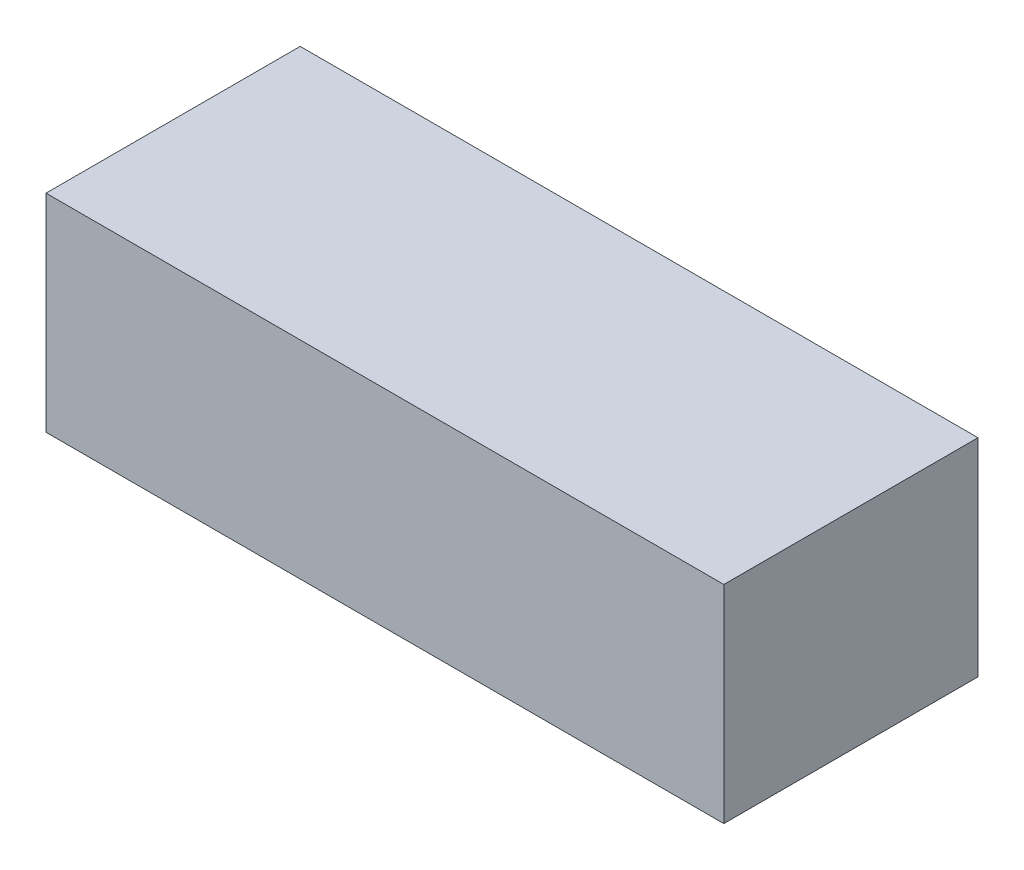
from build123d import *

# Parameters (mm, degrees)
SKETCH1_W           = 36
SKETCH1_H           = 11
BOSS_EXTRUDE1_DEPTH = 13.5


with BuildPart() as part:
    # Sketch1 → Boss-Extrude1 (new body)
    with BuildSketch(Plane.XY):
        with Locations((18, 5.5)):
            Rectangle(SKETCH1_W, SKETCH1_H)
    extrude(amount=BOSS_EXTRUDE1_DEPTH)


solid = part.part
